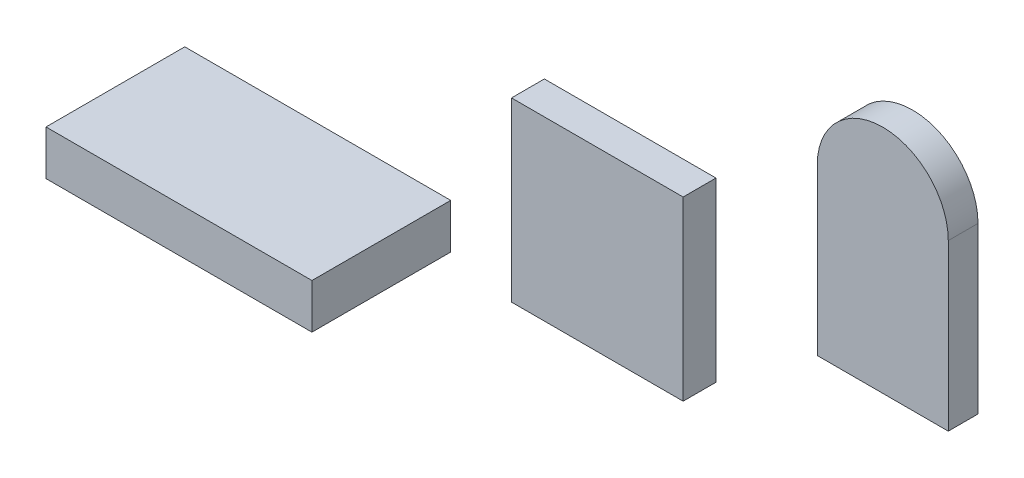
from build123d import *

# Parameters (mm, degrees)
SKETCH4_W           = 59.40797397
SKETCH4_H           = 10
EXTRUDE_THIN1_DEPTH = 31
SKETCH1_W           = 38.337165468
SKETCH1_H           = 39.50776594
BOSS_EXTRUDE3_DEPTH = 7.337359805
BOSS_EXTRUDE4_DEPTH = 6.638600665


with BuildPart() as part:
    # Sketch4 → Extrude-Thin1 (new body)
    with BuildSketch(Plane(origin=(0, -8.973738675, 0), x_dir=(1, 0, 0), z_dir=(0, 0, 1))):
        with Locations((-69.789442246, -10.219865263)):
            Rectangle(SKETCH4_W, SKETCH4_H)
    extrude(amount=EXTRUDE_THIN1_DEPTH)


with BuildPart() as body_2:
    # Sketch1 → Boss-Extrude3 (new body)
    with BuildSketch(Plane.XY):
        Rectangle(SKETCH1_W, SKETCH1_H)
    extrude(amount=BOSS_EXTRUDE3_DEPTH)


with BuildPart() as body_3:
    # Sketch2 → Boss-Extrude4 (new body)
    with BuildSketch(Plane.XY):
        with BuildLine():
            Line((48.433594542, 40.239391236), (48.433594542, 3.365476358))
            Line((48.433594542, 3.365476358), (77.698606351, 3.365476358))
            Line((77.698606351, 3.365476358), (77.698606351, 40.239391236))
            ThreePointArc((77.698606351, 40.239391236), (63.066100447, 54.87189714), (48.433594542, 40.239391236))
        make_face()
    extrude(amount=BOSS_EXTRUDE4_DEPTH)


solid = Compound([part.part, body_2.part, body_3.part])
